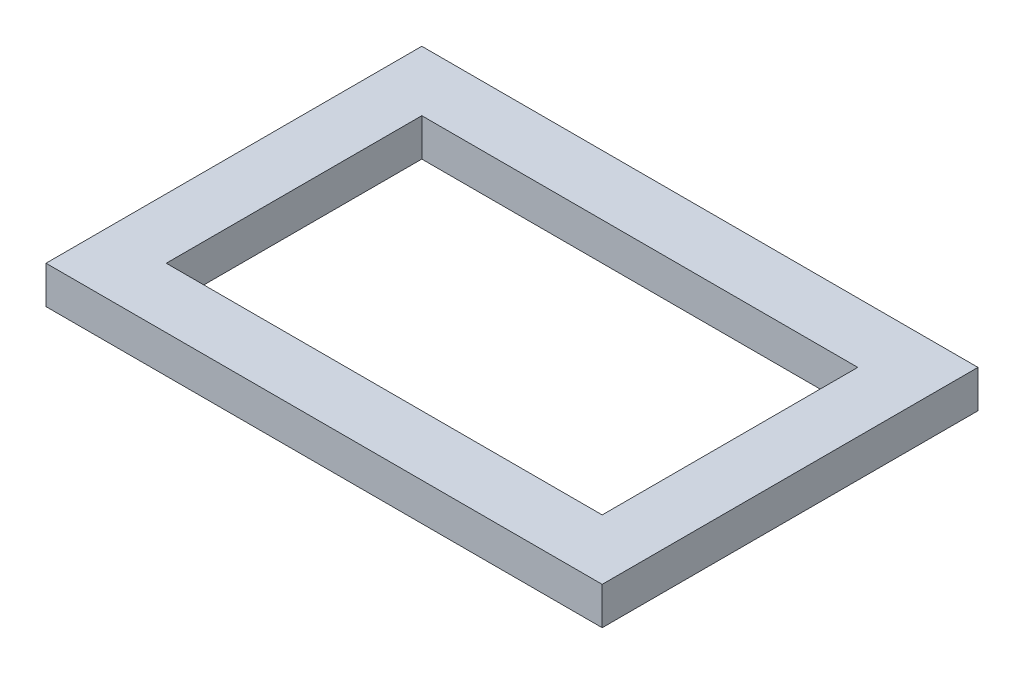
from build123d import *

# Parameters (mm, degrees)
SKETCH1_W           = 234.95
SKETCH1_H           = 158.75
SKETCH1_W_2         = 184.15
SKETCH1_H_2         = 107.95
BOSS_EXTRUDE1_DEPTH = 15.88


with BuildPart() as part:
    # Sketch1 → Boss-Extrude1 (new body)
    with BuildSketch(Plane(origin=(0, 0, 0), x_dir=(1, 0, 0), z_dir=(0, 1, 0))):
        Rectangle(SKETCH1_W, SKETCH1_H)
        Rectangle(SKETCH1_W_2, SKETCH1_H_2, mode=Mode.SUBTRACT)
    extrude(amount=BOSS_EXTRUDE1_DEPTH)


solid = part.part
